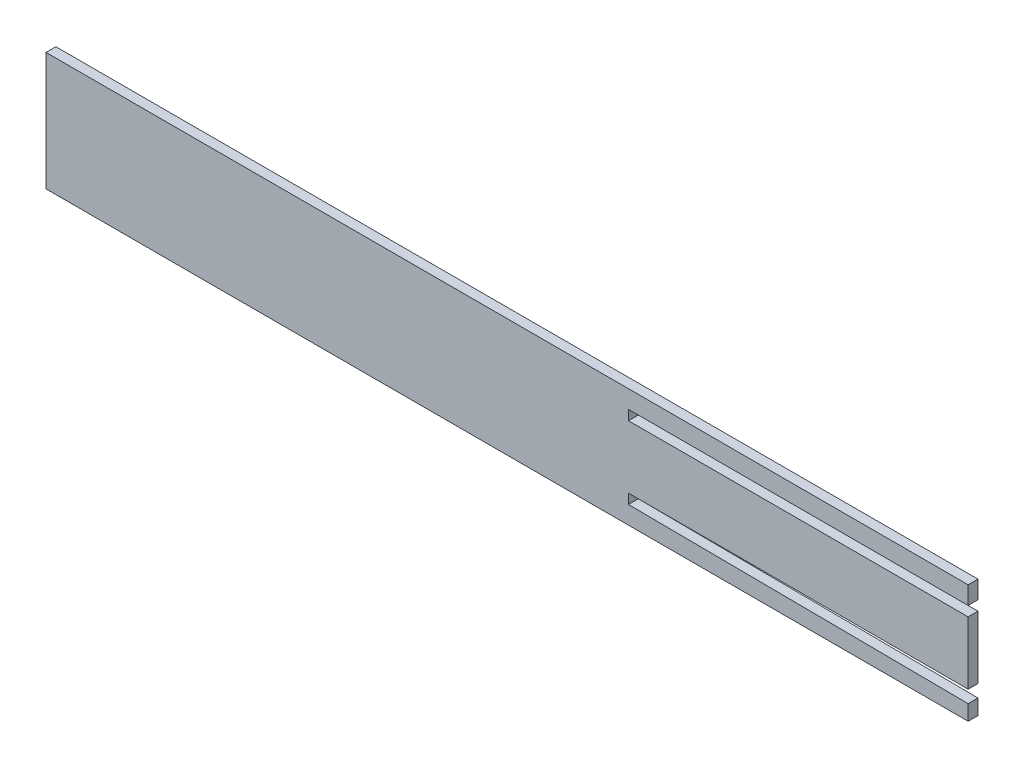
ISO-10303-21;
HEADER;
FILE_DESCRIPTION(('STEP AP214'),'2;1');
FILE_NAME('part.step','',(''),(''),'','','');
FILE_SCHEMA(('AUTOMOTIVE_DESIGN { 1 0 10303 214 1 1 1 1 }'));
ENDSEC;
DATA;
#1=APPLICATION_CONTEXT('core data for automotive mechanical design processes');
#2=APPLICATION_PROTOCOL_DEFINITION('international standard','automotive_design',2000,#1);
#3=PRODUCT_CONTEXT('',#1,'mechanical');
#4=PRODUCT('Part','Part','',(#3));
#5=PRODUCT_RELATED_PRODUCT_CATEGORY('part','',(#4));
#6=PRODUCT_DEFINITION_FORMATION('','',#4);
#7=PRODUCT_DEFINITION_CONTEXT('part definition',#1,'design');
#8=PRODUCT_DEFINITION('design','',#6,#7);
#9=PRODUCT_DEFINITION_SHAPE('','',#8);
#10=(LENGTH_UNIT() NAMED_UNIT(*) SI_UNIT(.MILLI.,.METRE.));
#11=(NAMED_UNIT(*) PLANE_ANGLE_UNIT() SI_UNIT($,.RADIAN.));
#12=(NAMED_UNIT(*) SI_UNIT($,.STERADIAN.) SOLID_ANGLE_UNIT());
#13=UNCERTAINTY_MEASURE_WITH_UNIT(LENGTH_MEASURE(1.E-05),#10,'distance_accuracy_value','');
#14=(GEOMETRIC_REPRESENTATION_CONTEXT(3) GLOBAL_UNCERTAINTY_ASSIGNED_CONTEXT((#13)) GLOBAL_UNIT_ASSIGNED_CONTEXT((#10,
#11,#12)) REPRESENTATION_CONTEXT('',''));
#15=CARTESIAN_POINT('',(0.,0.,0.));
#16=DIRECTION('',(0.,0.,1.));
#17=DIRECTION('',(1.,0.,0.));
#18=AXIS2_PLACEMENT_3D('',#15,#16,#17);
#19=CARTESIAN_POINT('',(0.,0.,5.5));
#20=DIRECTION('',(1.,0.,0.));
#21=DIRECTION('',(0.,0.,-1.));
#22=AXIS2_PLACEMENT_3D('',#19,#20,#21);
#23=PLANE('',#22);
#24=DIRECTION('',(0.,-1.,0.));
#25=VECTOR('',#24,1.);
#26=CARTESIAN_POINT('',(0.,0.,0.));
#27=LINE('',#26,#25);
#28=CARTESIAN_POINT('',(0.,66.,0.));
#29=VERTEX_POINT('',#28);
#30=CARTESIAN_POINT('',(0.,0.,0.));
#31=VERTEX_POINT('',#30);
#32=EDGE_CURVE('E161',#29,#31,#27,.T.);
#33=ORIENTED_EDGE('',*,*,#32,.T.);
#34=DIRECTION('',(0.,0.,-1.));
#35=VECTOR('',#34,1.);
#36=CARTESIAN_POINT('',(0.,0.,5.5));
#37=LINE('',#36,#35);
#38=CARTESIAN_POINT('',(0.,0.,5.5));
#39=VERTEX_POINT('',#38);
#40=EDGE_CURVE('E11',#39,#31,#37,.T.);
#41=ORIENTED_EDGE('',*,*,#40,.F.);
#42=DIRECTION('',(0.,-1.,0.));
#43=VECTOR('',#42,1.);
#44=CARTESIAN_POINT('',(0.,0.,5.5));
#45=LINE('',#44,#43);
#46=CARTESIAN_POINT('',(0.,66.,5.5));
#47=VERTEX_POINT('',#46);
#48=EDGE_CURVE('E184',#47,#39,#45,.T.);
#49=ORIENTED_EDGE('',*,*,#48,.F.);
#50=DIRECTION('',(0.,0.,-1.));
#51=VECTOR('',#50,1.);
#52=CARTESIAN_POINT('',(0.,66.,5.5));
#53=LINE('',#52,#51);
#54=EDGE_CURVE('E157',#47,#29,#53,.T.);
#55=ORIENTED_EDGE('',*,*,#54,.T.);
#56=EDGE_LOOP('',(#33,#41,#49,#55));
#57=FACE_BOUND('',#56,.T.);
#58=ADVANCED_FACE('F41',(#57),#23,.F.);
#59=CARTESIAN_POINT('',(0.,0.,5.5));
#60=DIRECTION('',(0.,1.,0.));
#61=DIRECTION('',(0.,0.,1.));
#62=AXIS2_PLACEMENT_3D('',#59,#60,#61);
#63=PLANE('',#62);
#64=DIRECTION('',(1.,0.,0.));
#65=VECTOR('',#64,1.);
#66=CARTESIAN_POINT('',(0.,0.,0.));
#67=LINE('',#66,#65);
#68=CARTESIAN_POINT('',(514.83,0.,0.));
#69=VERTEX_POINT('',#68);
#70=EDGE_CURVE('E164',#31,#69,#67,.T.);
#71=ORIENTED_EDGE('',*,*,#70,.T.);
#72=DIRECTION('',(0.,0.,-1.));
#73=VECTOR('',#72,1.);
#74=CARTESIAN_POINT('',(514.83,0.,5.5));
#75=LINE('',#74,#73);
#76=CARTESIAN_POINT('',(514.83,0.,5.5));
#77=VERTEX_POINT('',#76);
#78=EDGE_CURVE('E49',#77,#69,#75,.T.);
#79=ORIENTED_EDGE('',*,*,#78,.F.);
#80=DIRECTION('',(1.,0.,0.));
#81=VECTOR('',#80,1.);
#82=CARTESIAN_POINT('',(0.,0.,5.5));
#83=LINE('',#82,#81);
#84=EDGE_CURVE('E112',#39,#77,#83,.T.);
#85=ORIENTED_EDGE('',*,*,#84,.F.);
#86=ORIENTED_EDGE('',*,*,#40,.T.);
#87=EDGE_LOOP('',(#71,#79,#85,#86));
#88=FACE_BOUND('',#87,.T.);
#89=ADVANCED_FACE('F262',(#88),#63,.F.);
#90=CARTESIAN_POINT('',(514.83,8.52008247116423,5.5));
#91=DIRECTION('',(-1.,0.,0.));
#92=DIRECTION('',(0.,0.,1.));
#93=AXIS2_PLACEMENT_3D('',#90,#91,#92);
#94=PLANE('',#93);
#95=DIRECTION('',(0.,1.,0.));
#96=VECTOR('',#95,1.);
#97=CARTESIAN_POINT('',(514.83,8.52008247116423,0.));
#98=LINE('',#97,#96);
#99=CARTESIAN_POINT('',(514.83,8.52008247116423,0.));
#100=VERTEX_POINT('',#99);
#101=EDGE_CURVE('E166',#69,#100,#98,.T.);
#102=ORIENTED_EDGE('',*,*,#101,.T.);
#103=DIRECTION('',(0.,0.,-1.));
#104=VECTOR('',#103,1.);
#105=CARTESIAN_POINT('',(514.83,8.52008247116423,5.5));
#106=LINE('',#105,#104);
#107=CARTESIAN_POINT('',(514.83,8.52008247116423,5.5));
#108=VERTEX_POINT('',#107);
#109=EDGE_CURVE('E203',#108,#100,#106,.T.);
#110=ORIENTED_EDGE('',*,*,#109,.F.);
#111=DIRECTION('',(0.,1.,0.));
#112=VECTOR('',#111,1.);
#113=CARTESIAN_POINT('',(514.83,8.52008247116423,5.5));
#114=LINE('',#113,#112);
#115=EDGE_CURVE('E211',#77,#108,#114,.T.);
#116=ORIENTED_EDGE('',*,*,#115,.F.);
#117=ORIENTED_EDGE('',*,*,#78,.T.);
#118=EDGE_LOOP('',(#102,#110,#116,#117));
#119=FACE_BOUND('',#118,.T.);
#120=ADVANCED_FACE('F209',(#119),#94,.F.);
#121=CARTESIAN_POINT('',(325.19,9.99999999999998,5.5));
#122=DIRECTION('',(-0.00780358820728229,-0.999969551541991,0.));
#123=DIRECTION('',(0.999969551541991,-0.00780358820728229,0.));
#124=AXIS2_PLACEMENT_3D('',#121,#122,#123);
#125=PLANE('',#124);
#126=DIRECTION('',(-0.999969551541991,0.00780358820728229,0.));
#127=VECTOR('',#126,1.);
#128=CARTESIAN_POINT('',(325.19,9.99999999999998,0.));
#129=LINE('',#128,#127);
#130=CARTESIAN_POINT('',(325.19,9.99999999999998,0.));
#131=VERTEX_POINT('',#130);
#132=EDGE_CURVE('E168',#100,#131,#129,.T.);
#133=ORIENTED_EDGE('',*,*,#132,.T.);
#134=DIRECTION('',(0.,0.,-1.));
#135=VECTOR('',#134,1.);
#136=CARTESIAN_POINT('',(325.19,9.99999999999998,5.5));
#137=LINE('',#136,#135);
#138=CARTESIAN_POINT('',(325.19,9.99999999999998,5.5));
#139=VERTEX_POINT('',#138);
#140=EDGE_CURVE('E200',#139,#131,#137,.T.);
#141=ORIENTED_EDGE('',*,*,#140,.F.);
#142=DIRECTION('',(-0.999969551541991,0.00780358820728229,0.));
#143=VECTOR('',#142,1.);
#144=CARTESIAN_POINT('',(325.19,9.99999999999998,5.5));
#145=LINE('',#144,#143);
#146=EDGE_CURVE('E229',#108,#139,#145,.T.);
#147=ORIENTED_EDGE('',*,*,#146,.F.);
#148=ORIENTED_EDGE('',*,*,#109,.T.);
#149=EDGE_LOOP('',(#133,#141,#147,#148));
#150=FACE_BOUND('',#149,.T.);
#151=ADVANCED_FACE('F220',(#150),#125,.F.);
#152=CARTESIAN_POINT('',(325.19,15.5,5.5));
#153=DIRECTION('',(-1.,0.,0.));
#154=DIRECTION('',(0.,0.,1.));
#155=AXIS2_PLACEMENT_3D('',#152,#153,#154);
#156=PLANE('',#155);
#157=DIRECTION('',(0.,1.,0.));
#158=VECTOR('',#157,1.);
#159=CARTESIAN_POINT('',(325.19,15.5,0.));
#160=LINE('',#159,#158);
#161=CARTESIAN_POINT('',(325.19,15.5,0.));
#162=VERTEX_POINT('',#161);
#163=EDGE_CURVE('E170',#131,#162,#160,.T.);
#164=ORIENTED_EDGE('',*,*,#163,.T.);
#165=DIRECTION('',(0.,0.,-1.));
#166=VECTOR('',#165,1.);
#167=CARTESIAN_POINT('',(325.19,15.5,5.5));
#168=LINE('',#167,#166);
#169=CARTESIAN_POINT('',(325.19,15.5,5.5));
#170=VERTEX_POINT('',#169);
#171=EDGE_CURVE('E197',#170,#162,#168,.T.);
#172=ORIENTED_EDGE('',*,*,#171,.F.);
#173=DIRECTION('',(0.,1.,0.));
#174=VECTOR('',#173,1.);
#175=CARTESIAN_POINT('',(325.19,15.5,5.5));
#176=LINE('',#175,#174);
#177=EDGE_CURVE('E226',#139,#170,#176,.T.);
#178=ORIENTED_EDGE('',*,*,#177,.F.);
#179=ORIENTED_EDGE('',*,*,#140,.T.);
#180=EDGE_LOOP('',(#164,#172,#178,#179));
#181=FACE_BOUND('',#180,.T.);
#182=ADVANCED_FACE('F224',(#181),#156,.F.);
#183=CARTESIAN_POINT('',(514.83,15.5,5.5));
#184=DIRECTION('',(0.,1.,0.));
#185=DIRECTION('',(0.,0.,1.));
#186=AXIS2_PLACEMENT_3D('',#183,#184,#185);
#187=PLANE('',#186);
#188=DIRECTION('',(1.,0.,0.));
#189=VECTOR('',#188,1.);
#190=CARTESIAN_POINT('',(514.83,15.5,0.));
#191=LINE('',#190,#189);
#192=CARTESIAN_POINT('',(514.83,15.5,0.));
#193=VERTEX_POINT('',#192);
#194=EDGE_CURVE('E172',#162,#193,#191,.T.);
#195=ORIENTED_EDGE('',*,*,#194,.T.);
#196=DIRECTION('',(0.,0.,-1.));
#197=VECTOR('',#196,1.);
#198=CARTESIAN_POINT('',(514.83,15.5,5.5));
#199=LINE('',#198,#197);
#200=CARTESIAN_POINT('',(514.83,15.5,5.5));
#201=VERTEX_POINT('',#200);
#202=EDGE_CURVE('E194',#201,#193,#199,.T.);
#203=ORIENTED_EDGE('',*,*,#202,.F.);
#204=DIRECTION('',(1.,0.,0.));
#205=VECTOR('',#204,1.);
#206=CARTESIAN_POINT('',(514.83,15.5,5.5));
#207=LINE('',#206,#205);
#208=EDGE_CURVE('E228',#170,#201,#207,.T.);
#209=ORIENTED_EDGE('',*,*,#208,.F.);
#210=ORIENTED_EDGE('',*,*,#171,.T.);
#211=EDGE_LOOP('',(#195,#203,#209,#210));
#212=FACE_BOUND('',#211,.T.);
#213=ADVANCED_FACE('F275',(#212),#187,.F.);
#214=CARTESIAN_POINT('',(514.83,50.5,5.5));
#215=DIRECTION('',(-1.,0.,0.));
#216=DIRECTION('',(0.,0.,1.));
#217=AXIS2_PLACEMENT_3D('',#214,#215,#216);
#218=PLANE('',#217);
#219=DIRECTION('',(0.,1.,0.));
#220=VECTOR('',#219,1.);
#221=CARTESIAN_POINT('',(514.83,50.5,0.));
#222=LINE('',#221,#220);
#223=CARTESIAN_POINT('',(514.83,50.5,0.));
#224=VERTEX_POINT('',#223);
#225=EDGE_CURVE('E175',#193,#224,#222,.T.);
#226=ORIENTED_EDGE('',*,*,#225,.T.);
#227=DIRECTION('',(0.,0.,-1.));
#228=VECTOR('',#227,1.);
#229=CARTESIAN_POINT('',(514.83,50.5,5.5));
#230=LINE('',#229,#228);
#231=CARTESIAN_POINT('',(514.83,50.5,5.5));
#232=VERTEX_POINT('',#231);
#233=EDGE_CURVE('E191',#232,#224,#230,.T.);
#234=ORIENTED_EDGE('',*,*,#233,.F.);
#235=DIRECTION('',(0.,1.,0.));
#236=VECTOR('',#235,1.);
#237=CARTESIAN_POINT('',(514.83,33.,5.5));
#238=LINE('',#237,#236);
#239=EDGE_CURVE('E231',#201,#232,#238,.T.);
#240=ORIENTED_EDGE('',*,*,#239,.F.);
#241=ORIENTED_EDGE('',*,*,#202,.T.);
#242=EDGE_LOOP('',(#226,#234,#240,#241));
#243=FACE_BOUND('',#242,.T.);
#244=ADVANCED_FACE('F278',(#243),#218,.F.);
#245=CARTESIAN_POINT('',(325.19,50.5,5.5));
#246=DIRECTION('',(0.,-1.,0.));
#247=DIRECTION('',(0.,0.,-1.));
#248=AXIS2_PLACEMENT_3D('',#245,#246,#247);
#249=PLANE('',#248);
#250=DIRECTION('',(-1.,0.,0.));
#251=VECTOR('',#250,1.);
#252=CARTESIAN_POINT('',(325.19,50.5,0.));
#253=LINE('',#252,#251);
#254=CARTESIAN_POINT('',(325.19,50.5,0.));
#255=VERTEX_POINT('',#254);
#256=EDGE_CURVE('E177',#224,#255,#253,.T.);
#257=ORIENTED_EDGE('',*,*,#256,.T.);
#258=DIRECTION('',(0.,0.,-1.));
#259=VECTOR('',#258,1.);
#260=CARTESIAN_POINT('',(325.19,50.5,5.5));
#261=LINE('',#260,#259);
#262=CARTESIAN_POINT('',(325.19,50.5,5.5));
#263=VERTEX_POINT('',#262);
#264=EDGE_CURVE('E188',#263,#255,#261,.T.);
#265=ORIENTED_EDGE('',*,*,#264,.F.);
#266=DIRECTION('',(-1.,0.,0.));
#267=VECTOR('',#266,1.);
#268=CARTESIAN_POINT('',(325.19,50.5,5.5));
#269=LINE('',#268,#267);
#270=EDGE_CURVE('E237',#232,#263,#269,.T.);
#271=ORIENTED_EDGE('',*,*,#270,.F.);
#272=ORIENTED_EDGE('',*,*,#233,.T.);
#273=EDGE_LOOP('',(#257,#265,#271,#272));
#274=FACE_BOUND('',#273,.T.);
#275=ADVANCED_FACE('F243',(#274),#249,.F.);
#276=CARTESIAN_POINT('',(325.19,56.,5.5));
#277=DIRECTION('',(-1.,0.,0.));
#278=DIRECTION('',(0.,0.,1.));
#279=AXIS2_PLACEMENT_3D('',#276,#277,#278);
#280=PLANE('',#279);
#281=DIRECTION('',(0.,1.,0.));
#282=VECTOR('',#281,1.);
#283=CARTESIAN_POINT('',(325.19,56.,0.));
#284=LINE('',#283,#282);
#285=CARTESIAN_POINT('',(325.19,56.,0.));
#286=VERTEX_POINT('',#285);
#287=EDGE_CURVE('E179',#255,#286,#284,.T.);
#288=ORIENTED_EDGE('',*,*,#287,.T.);
#289=DIRECTION('',(0.,0.,-1.));
#290=VECTOR('',#289,1.);
#291=CARTESIAN_POINT('',(325.19,56.,5.5));
#292=LINE('',#291,#290);
#293=CARTESIAN_POINT('',(325.19,56.,5.5));
#294=VERTEX_POINT('',#293);
#295=EDGE_CURVE('E152',#294,#286,#292,.T.);
#296=ORIENTED_EDGE('',*,*,#295,.F.);
#297=DIRECTION('',(0.,1.,0.));
#298=VECTOR('',#297,1.);
#299=CARTESIAN_POINT('',(325.19,56.,5.5));
#300=LINE('',#299,#298);
#301=EDGE_CURVE('E143',#263,#294,#300,.T.);
#302=ORIENTED_EDGE('',*,*,#301,.F.);
#303=ORIENTED_EDGE('',*,*,#264,.T.);
#304=EDGE_LOOP('',(#288,#296,#302,#303));
#305=FACE_BOUND('',#304,.T.);
#306=ADVANCED_FACE('F247',(#305),#280,.F.);
#307=CARTESIAN_POINT('',(514.83,56.,5.5));
#308=DIRECTION('',(0.,1.,0.));
#309=DIRECTION('',(0.,0.,1.));
#310=AXIS2_PLACEMENT_3D('',#307,#308,#309);
#311=PLANE('',#310);
#312=DIRECTION('',(1.,0.,0.));
#313=VECTOR('',#312,1.);
#314=CARTESIAN_POINT('',(514.83,56.,0.));
#315=LINE('',#314,#313);
#316=CARTESIAN_POINT('',(514.83,56.,0.));
#317=VERTEX_POINT('',#316);
#318=EDGE_CURVE('E151',#286,#317,#315,.T.);
#319=ORIENTED_EDGE('',*,*,#318,.T.);
#320=DIRECTION('',(0.,0.,-1.));
#321=VECTOR('',#320,1.);
#322=CARTESIAN_POINT('',(514.83,56.,5.5));
#323=LINE('',#322,#321);
#324=CARTESIAN_POINT('',(514.83,56.,5.5));
#325=VERTEX_POINT('',#324);
#326=EDGE_CURVE('E148',#325,#317,#323,.T.);
#327=ORIENTED_EDGE('',*,*,#326,.F.);
#328=DIRECTION('',(1.,0.,0.));
#329=VECTOR('',#328,1.);
#330=CARTESIAN_POINT('',(514.83,56.,5.5));
#331=LINE('',#330,#329);
#332=EDGE_CURVE('E137',#294,#325,#331,.T.);
#333=ORIENTED_EDGE('',*,*,#332,.F.);
#334=ORIENTED_EDGE('',*,*,#295,.T.);
#335=EDGE_LOOP('',(#319,#327,#333,#334));
#336=FACE_BOUND('',#335,.T.);
#337=ADVANCED_FACE('F149',(#336),#311,.F.);
#338=CARTESIAN_POINT('',(514.83,56.,5.5));
#339=DIRECTION('',(-1.,0.,0.));
#340=DIRECTION('',(0.,0.,1.));
#341=AXIS2_PLACEMENT_3D('',#338,#339,#340);
#342=PLANE('',#341);
#343=DIRECTION('',(0.,1.,0.));
#344=VECTOR('',#343,1.);
#345=CARTESIAN_POINT('',(514.83,56.,0.));
#346=LINE('',#345,#344);
#347=CARTESIAN_POINT('',(514.83,66.,0.));
#348=VERTEX_POINT('',#347);
#349=EDGE_CURVE('E98',#317,#348,#346,.T.);
#350=ORIENTED_EDGE('',*,*,#349,.T.);
#351=DIRECTION('',(0.,0.,-1.));
#352=VECTOR('',#351,1.);
#353=CARTESIAN_POINT('',(514.83,66.,5.5));
#354=LINE('',#353,#352);
#355=CARTESIAN_POINT('',(514.83,66.,5.5));
#356=VERTEX_POINT('',#355);
#357=EDGE_CURVE('E153',#356,#348,#354,.T.);
#358=ORIENTED_EDGE('',*,*,#357,.F.);
#359=DIRECTION('',(0.,1.,0.));
#360=VECTOR('',#359,1.);
#361=CARTESIAN_POINT('',(514.83,56.,5.5));
#362=LINE('',#361,#360);
#363=EDGE_CURVE('E141',#325,#356,#362,.T.);
#364=ORIENTED_EDGE('',*,*,#363,.F.);
#365=ORIENTED_EDGE('',*,*,#326,.T.);
#366=EDGE_LOOP('',(#350,#358,#364,#365));
#367=FACE_BOUND('',#366,.T.);
#368=ADVANCED_FACE('F155',(#367),#342,.F.);
#369=CARTESIAN_POINT('',(0.,66.,5.5));
#370=DIRECTION('',(0.,-1.,0.));
#371=DIRECTION('',(0.,0.,-1.));
#372=AXIS2_PLACEMENT_3D('',#369,#370,#371);
#373=PLANE('',#372);
#374=DIRECTION('',(-1.,0.,0.));
#375=VECTOR('',#374,1.);
#376=CARTESIAN_POINT('',(0.,66.,0.));
#377=LINE('',#376,#375);
#378=EDGE_CURVE('E104',#348,#29,#377,.T.);
#379=ORIENTED_EDGE('',*,*,#378,.T.);
#380=ORIENTED_EDGE('',*,*,#54,.F.);
#381=DIRECTION('',(-1.,0.,0.));
#382=VECTOR('',#381,1.);
#383=CARTESIAN_POINT('',(0.,66.,5.5));
#384=LINE('',#383,#382);
#385=EDGE_CURVE('E57',#356,#47,#384,.T.);
#386=ORIENTED_EDGE('',*,*,#385,.F.);
#387=ORIENTED_EDGE('',*,*,#357,.T.);
#388=EDGE_LOOP('',(#379,#380,#386,#387));
#389=FACE_BOUND('',#388,.T.);
#390=ADVANCED_FACE('F251',(#389),#373,.F.);
#391=CARTESIAN_POINT('',(0.,0.,5.5));
#392=DIRECTION('',(0.,0.,-1.));
#393=DIRECTION('',(-1.,0.,0.));
#394=AXIS2_PLACEMENT_3D('',#391,#392,#393);
#395=PLANE('',#394);
#396=ORIENTED_EDGE('',*,*,#48,.T.);
#397=ORIENTED_EDGE('',*,*,#84,.T.);
#398=ORIENTED_EDGE('',*,*,#115,.T.);
#399=ORIENTED_EDGE('',*,*,#146,.T.);
#400=ORIENTED_EDGE('',*,*,#177,.T.);
#401=ORIENTED_EDGE('',*,*,#208,.T.);
#402=ORIENTED_EDGE('',*,*,#239,.T.);
#403=ORIENTED_EDGE('',*,*,#270,.T.);
#404=ORIENTED_EDGE('',*,*,#301,.T.);
#405=ORIENTED_EDGE('',*,*,#332,.T.);
#406=ORIENTED_EDGE('',*,*,#363,.T.);
#407=ORIENTED_EDGE('',*,*,#385,.T.);
#408=EDGE_LOOP('',(#396,#397,#398,#399,#400,#401,#402,#403,#404,#405,#406,#407));
#409=FACE_BOUND('',#408,.T.);
#410=ADVANCED_FACE('F139',(#409),#395,.F.);
#411=CARTESIAN_POINT('',(0.,0.,0.));
#412=DIRECTION('',(0.,0.,-1.));
#413=DIRECTION('',(-1.,0.,0.));
#414=AXIS2_PLACEMENT_3D('',#411,#412,#413);
#415=PLANE('',#414);
#416=ORIENTED_EDGE('',*,*,#32,.F.);
#417=ORIENTED_EDGE('',*,*,#378,.F.);
#418=ORIENTED_EDGE('',*,*,#349,.F.);
#419=ORIENTED_EDGE('',*,*,#318,.F.);
#420=ORIENTED_EDGE('',*,*,#287,.F.);
#421=ORIENTED_EDGE('',*,*,#256,.F.);
#422=ORIENTED_EDGE('',*,*,#225,.F.);
#423=ORIENTED_EDGE('',*,*,#194,.F.);
#424=ORIENTED_EDGE('',*,*,#163,.F.);
#425=ORIENTED_EDGE('',*,*,#132,.F.);
#426=ORIENTED_EDGE('',*,*,#101,.F.);
#427=ORIENTED_EDGE('',*,*,#70,.F.);
#428=EDGE_LOOP('',(#416,#417,#418,#419,#420,#421,#422,#423,#424,#425,#426,#427));
#429=FACE_BOUND('',#428,.T.);
#430=ADVANCED_FACE('F215',(#429),#415,.T.);
#431=CLOSED_SHELL('',(#58,#89,#120,#151,#182,#213,#244,#275,#306,#337,#368,#390,#410,#430));
#432=MANIFOLD_SOLID_BREP('B2',#431);
#433=ADVANCED_BREP_SHAPE_REPRESENTATION('',(#18,#432),#14);
#434=SHAPE_DEFINITION_REPRESENTATION(#9,#433);
ENDSEC;
END-ISO-10303-21;
